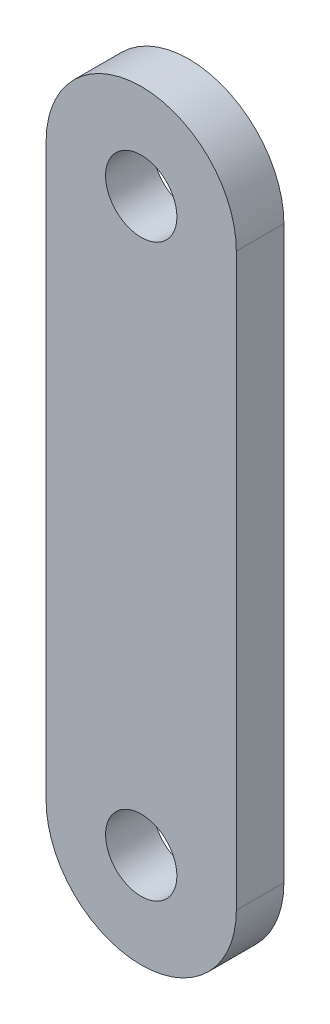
ISO-10303-21;
HEADER;
FILE_DESCRIPTION(('STEP AP214'),'2;1');
FILE_NAME('part.step','',(''),(''),'','','');
FILE_SCHEMA(('AUTOMOTIVE_DESIGN { 1 0 10303 214 1 1 1 1 }'));
ENDSEC;
DATA;
#1=APPLICATION_CONTEXT('core data for automotive mechanical design processes');
#2=APPLICATION_PROTOCOL_DEFINITION('international standard','automotive_design',2000,#1);
#3=PRODUCT_CONTEXT('',#1,'mechanical');
#4=PRODUCT('Part','Part','',(#3));
#5=PRODUCT_RELATED_PRODUCT_CATEGORY('part','',(#4));
#6=PRODUCT_DEFINITION_FORMATION('','',#4);
#7=PRODUCT_DEFINITION_CONTEXT('part definition',#1,'design');
#8=PRODUCT_DEFINITION('design','',#6,#7);
#9=PRODUCT_DEFINITION_SHAPE('','',#8);
#10=(LENGTH_UNIT() NAMED_UNIT(*) SI_UNIT(.MILLI.,.METRE.));
#11=(NAMED_UNIT(*) PLANE_ANGLE_UNIT() SI_UNIT($,.RADIAN.));
#12=(NAMED_UNIT(*) SI_UNIT($,.STERADIAN.) SOLID_ANGLE_UNIT());
#13=UNCERTAINTY_MEASURE_WITH_UNIT(LENGTH_MEASURE(1.E-05),#10,'distance_accuracy_value','');
#14=(GEOMETRIC_REPRESENTATION_CONTEXT(3) GLOBAL_UNCERTAINTY_ASSIGNED_CONTEXT((#13)) GLOBAL_UNIT_ASSIGNED_CONTEXT((#10,
#11,#12)) REPRESENTATION_CONTEXT('',''));
#15=CARTESIAN_POINT('',(0.,0.,0.));
#16=DIRECTION('',(0.,0.,1.));
#17=DIRECTION('',(1.,0.,0.));
#18=AXIS2_PLACEMENT_3D('',#15,#16,#17);
#19=CARTESIAN_POINT('',(254.,-177.8,6.35));
#20=DIRECTION('',(0.,0.,1.));
#21=DIRECTION('',(1.,0.,0.));
#22=AXIS2_PLACEMENT_3D('',#19,#20,#21);
#23=PLANE('',#22);
#24=CARTESIAN_POINT('',(254.,-330.2,6.35));
#25=DIRECTION('',(0.,0.,1.));
#26=DIRECTION('',(1.,0.,0.));
#27=AXIS2_PLACEMENT_3D('',#24,#25,#26);
#28=CIRCLE('',#27,9.52500000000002);
#29=CARTESIAN_POINT('',(263.525,-330.2,6.35));
#30=VERTEX_POINT('',#29);
#31=EDGE_CURVE('E99',#30,#30,#28,.T.);
#32=ORIENTED_EDGE('',*,*,#31,.F.);
#33=EDGE_LOOP('',(#32));
#34=FACE_BOUND('',#33,.T.);
#35=CARTESIAN_POINT('',(254.,-177.8,6.35));
#36=DIRECTION('',(0.,0.,1.));
#37=DIRECTION('',(1.,0.,0.));
#38=AXIS2_PLACEMENT_3D('',#35,#36,#37);
#39=CIRCLE('',#38,25.3999999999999);
#40=CARTESIAN_POINT('',(279.4,-177.8,6.35));
#41=VERTEX_POINT('',#40);
#42=CARTESIAN_POINT('',(228.6,-177.8,6.35));
#43=VERTEX_POINT('',#42);
#44=EDGE_CURVE('E84',#41,#43,#39,.T.);
#45=ORIENTED_EDGE('',*,*,#44,.T.);
#46=DIRECTION('',(0.,-1.,0.));
#47=VECTOR('',#46,1.);
#48=CARTESIAN_POINT('',(228.6,-177.8,6.35));
#49=LINE('',#48,#47);
#50=CARTESIAN_POINT('',(228.6,-330.2,6.35));
#51=VERTEX_POINT('',#50);
#52=EDGE_CURVE('E79',#43,#51,#49,.T.);
#53=ORIENTED_EDGE('',*,*,#52,.T.);
#54=CARTESIAN_POINT('',(254.,-330.2,6.35));
#55=DIRECTION('',(0.,0.,1.));
#56=DIRECTION('',(1.,0.,0.));
#57=AXIS2_PLACEMENT_3D('',#54,#55,#56);
#58=CIRCLE('',#57,25.3999999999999);
#59=CARTESIAN_POINT('',(279.4,-330.2,6.35));
#60=VERTEX_POINT('',#59);
#61=EDGE_CURVE('E82',#51,#60,#58,.T.);
#62=ORIENTED_EDGE('',*,*,#61,.T.);
#63=DIRECTION('',(0.,1.,0.));
#64=VECTOR('',#63,1.);
#65=CARTESIAN_POINT('',(279.4,-177.8,6.35));
#66=LINE('',#65,#64);
#67=EDGE_CURVE('E49',#60,#41,#66,.T.);
#68=ORIENTED_EDGE('',*,*,#67,.T.);
#69=EDGE_LOOP('',(#45,#53,#62,#68));
#70=FACE_BOUND('',#69,.T.);
#71=CARTESIAN_POINT('',(254.,-177.8,6.35));
#72=DIRECTION('',(0.,0.,1.));
#73=DIRECTION('',(1.,0.,0.));
#74=AXIS2_PLACEMENT_3D('',#71,#72,#73);
#75=CIRCLE('',#74,9.52500000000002);
#76=CARTESIAN_POINT('',(263.525,-177.8,6.35));
#77=VERTEX_POINT('',#76);
#78=EDGE_CURVE('E114',#77,#77,#75,.T.);
#79=ORIENTED_EDGE('',*,*,#78,.F.);
#80=EDGE_LOOP('',(#79));
#81=FACE_BOUND('',#80,.T.);
#82=ADVANCED_FACE('F32',(#34,#70,#81),#23,.T.);
#83=CARTESIAN_POINT('',(254.,-177.8,-6.35));
#84=DIRECTION('',(0.,0.,1.));
#85=DIRECTION('',(1.,0.,0.));
#86=AXIS2_PLACEMENT_3D('',#83,#84,#85);
#87=PLANE('',#86);
#88=CARTESIAN_POINT('',(254.,-177.8,-6.35));
#89=DIRECTION('',(0.,0.,1.));
#90=DIRECTION('',(1.,0.,0.));
#91=AXIS2_PLACEMENT_3D('',#88,#89,#90);
#92=CIRCLE('',#91,25.3999999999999);
#93=CARTESIAN_POINT('',(279.4,-177.8,-6.35));
#94=VERTEX_POINT('',#93);
#95=CARTESIAN_POINT('',(228.6,-177.8,-6.35));
#96=VERTEX_POINT('',#95);
#97=EDGE_CURVE('E96',#94,#96,#92,.T.);
#98=ORIENTED_EDGE('',*,*,#97,.F.);
#99=DIRECTION('',(0.,1.,0.));
#100=VECTOR('',#99,1.);
#101=CARTESIAN_POINT('',(279.4,-177.8,-6.35));
#102=LINE('',#101,#100);
#103=CARTESIAN_POINT('',(279.4,-330.2,-6.35));
#104=VERTEX_POINT('',#103);
#105=EDGE_CURVE('E72',#104,#94,#102,.T.);
#106=ORIENTED_EDGE('',*,*,#105,.F.);
#107=CARTESIAN_POINT('',(254.,-330.2,-6.35));
#108=DIRECTION('',(0.,0.,1.));
#109=DIRECTION('',(1.,0.,0.));
#110=AXIS2_PLACEMENT_3D('',#107,#108,#109);
#111=CIRCLE('',#110,25.3999999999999);
#112=CARTESIAN_POINT('',(228.6,-330.2,-6.35));
#113=VERTEX_POINT('',#112);
#114=EDGE_CURVE('E66',#113,#104,#111,.T.);
#115=ORIENTED_EDGE('',*,*,#114,.F.);
#116=DIRECTION('',(0.,-1.,0.));
#117=VECTOR('',#116,1.);
#118=CARTESIAN_POINT('',(228.6,-177.8,-6.35));
#119=LINE('',#118,#117);
#120=EDGE_CURVE('E88',#96,#113,#119,.T.);
#121=ORIENTED_EDGE('',*,*,#120,.F.);
#122=EDGE_LOOP('',(#98,#106,#115,#121));
#123=FACE_BOUND('',#122,.T.);
#124=CARTESIAN_POINT('',(254.,-330.2,-6.35));
#125=DIRECTION('',(0.,0.,1.));
#126=DIRECTION('',(1.,0.,0.));
#127=AXIS2_PLACEMENT_3D('',#124,#125,#126);
#128=CIRCLE('',#127,9.52500000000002);
#129=CARTESIAN_POINT('',(263.525,-330.2,-6.35));
#130=VERTEX_POINT('',#129);
#131=EDGE_CURVE('E111',#130,#130,#128,.T.);
#132=ORIENTED_EDGE('',*,*,#131,.T.);
#133=EDGE_LOOP('',(#132));
#134=FACE_BOUND('',#133,.T.);
#135=CARTESIAN_POINT('',(254.,-177.8,-6.35));
#136=DIRECTION('',(0.,0.,1.));
#137=DIRECTION('',(1.,0.,0.));
#138=AXIS2_PLACEMENT_3D('',#135,#136,#137);
#139=CIRCLE('',#138,9.52500000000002);
#140=CARTESIAN_POINT('',(263.525,-177.8,-6.35));
#141=VERTEX_POINT('',#140);
#142=EDGE_CURVE('E117',#141,#141,#139,.T.);
#143=ORIENTED_EDGE('',*,*,#142,.T.);
#144=EDGE_LOOP('',(#143));
#145=FACE_BOUND('',#144,.T.);
#146=ADVANCED_FACE('F107',(#123,#134,#145),#87,.F.);
#147=CARTESIAN_POINT('',(254.,-177.8,6.35));
#148=DIRECTION('',(0.,0.,-1.));
#149=DIRECTION('',(-1.,0.,0.));
#150=AXIS2_PLACEMENT_3D('',#147,#148,#149);
#151=CYLINDRICAL_SURFACE('',#150,25.3999999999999);
#152=ORIENTED_EDGE('',*,*,#97,.T.);
#153=DIRECTION('',(0.,0.,-1.));
#154=VECTOR('',#153,1.);
#155=CARTESIAN_POINT('',(228.6,-177.8,6.35));
#156=LINE('',#155,#154);
#157=EDGE_CURVE('E11',#43,#96,#156,.T.);
#158=ORIENTED_EDGE('',*,*,#157,.F.);
#159=ORIENTED_EDGE('',*,*,#44,.F.);
#160=DIRECTION('',(0.,0.,-1.));
#161=VECTOR('',#160,1.);
#162=CARTESIAN_POINT('',(279.4,-177.8,6.35));
#163=LINE('',#162,#161);
#164=EDGE_CURVE('E92',#41,#94,#163,.T.);
#165=ORIENTED_EDGE('',*,*,#164,.T.);
#166=EDGE_LOOP('',(#152,#158,#159,#165));
#167=FACE_BOUND('',#166,.T.);
#168=ADVANCED_FACE('F34',(#167),#151,.T.);
#169=CARTESIAN_POINT('',(228.6,-177.8,6.35));
#170=DIRECTION('',(1.,0.,0.));
#171=DIRECTION('',(0.,1.,0.));
#172=AXIS2_PLACEMENT_3D('',#169,#170,#171);
#173=PLANE('',#172);
#174=ORIENTED_EDGE('',*,*,#120,.T.);
#175=DIRECTION('',(0.,0.,-1.));
#176=VECTOR('',#175,1.);
#177=CARTESIAN_POINT('',(228.6,-330.2,6.35));
#178=LINE('',#177,#176);
#179=EDGE_CURVE('E41',#51,#113,#178,.T.);
#180=ORIENTED_EDGE('',*,*,#179,.F.);
#181=ORIENTED_EDGE('',*,*,#52,.F.);
#182=ORIENTED_EDGE('',*,*,#157,.T.);
#183=EDGE_LOOP('',(#174,#180,#181,#182));
#184=FACE_BOUND('',#183,.T.);
#185=ADVANCED_FACE('F87',(#184),#173,.F.);
#186=CARTESIAN_POINT('',(254.,-330.2,6.35));
#187=DIRECTION('',(0.,0.,-1.));
#188=DIRECTION('',(-1.,0.,0.));
#189=AXIS2_PLACEMENT_3D('',#186,#187,#188);
#190=CYLINDRICAL_SURFACE('',#189,25.3999999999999);
#191=ORIENTED_EDGE('',*,*,#114,.T.);
#192=DIRECTION('',(0.,0.,-1.));
#193=VECTOR('',#192,1.);
#194=CARTESIAN_POINT('',(279.4,-330.2,6.35));
#195=LINE('',#194,#193);
#196=EDGE_CURVE('E89',#60,#104,#195,.T.);
#197=ORIENTED_EDGE('',*,*,#196,.F.);
#198=ORIENTED_EDGE('',*,*,#61,.F.);
#199=ORIENTED_EDGE('',*,*,#179,.T.);
#200=EDGE_LOOP('',(#191,#197,#198,#199));
#201=FACE_BOUND('',#200,.T.);
#202=ADVANCED_FACE('F90',(#201),#190,.T.);
#203=CARTESIAN_POINT('',(279.4,-177.8,6.35));
#204=DIRECTION('',(-1.,0.,0.));
#205=DIRECTION('',(0.,0.,1.));
#206=AXIS2_PLACEMENT_3D('',#203,#204,#205);
#207=PLANE('',#206);
#208=ORIENTED_EDGE('',*,*,#105,.T.);
#209=ORIENTED_EDGE('',*,*,#164,.F.);
#210=ORIENTED_EDGE('',*,*,#67,.F.);
#211=ORIENTED_EDGE('',*,*,#196,.T.);
#212=EDGE_LOOP('',(#208,#209,#210,#211));
#213=FACE_BOUND('',#212,.T.);
#214=ADVANCED_FACE('F104',(#213),#207,.F.);
#215=CARTESIAN_POINT('',(254.,-330.2,6.35));
#216=DIRECTION('',(0.,0.,-1.));
#217=DIRECTION('',(-1.,0.,0.));
#218=AXIS2_PLACEMENT_3D('',#215,#216,#217);
#219=CYLINDRICAL_SURFACE('',#218,9.52500000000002);
#220=ORIENTED_EDGE('',*,*,#31,.T.);
#221=EDGE_LOOP('',(#220));
#222=FACE_BOUND('',#221,.T.);
#223=ORIENTED_EDGE('',*,*,#131,.F.);
#224=EDGE_LOOP('',(#223));
#225=FACE_BOUND('',#224,.T.);
#226=ADVANCED_FACE('F134',(#222,#225),#219,.F.);
#227=CARTESIAN_POINT('',(254.,-177.8,6.35));
#228=DIRECTION('',(0.,0.,-1.));
#229=DIRECTION('',(-1.,0.,0.));
#230=AXIS2_PLACEMENT_3D('',#227,#228,#229);
#231=CYLINDRICAL_SURFACE('',#230,9.52500000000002);
#232=ORIENTED_EDGE('',*,*,#78,.T.);
#233=EDGE_LOOP('',(#232));
#234=FACE_BOUND('',#233,.T.);
#235=ORIENTED_EDGE('',*,*,#142,.F.);
#236=EDGE_LOOP('',(#235));
#237=FACE_BOUND('',#236,.T.);
#238=ADVANCED_FACE('F123',(#234,#237),#231,.F.);
#239=CLOSED_SHELL('',(#82,#146,#168,#185,#202,#214,#226,#238));
#240=MANIFOLD_SOLID_BREP('B2',#239);
#241=ADVANCED_BREP_SHAPE_REPRESENTATION('',(#18,#240),#14);
#242=SHAPE_DEFINITION_REPRESENTATION(#9,#241);
ENDSEC;
END-ISO-10303-21;
